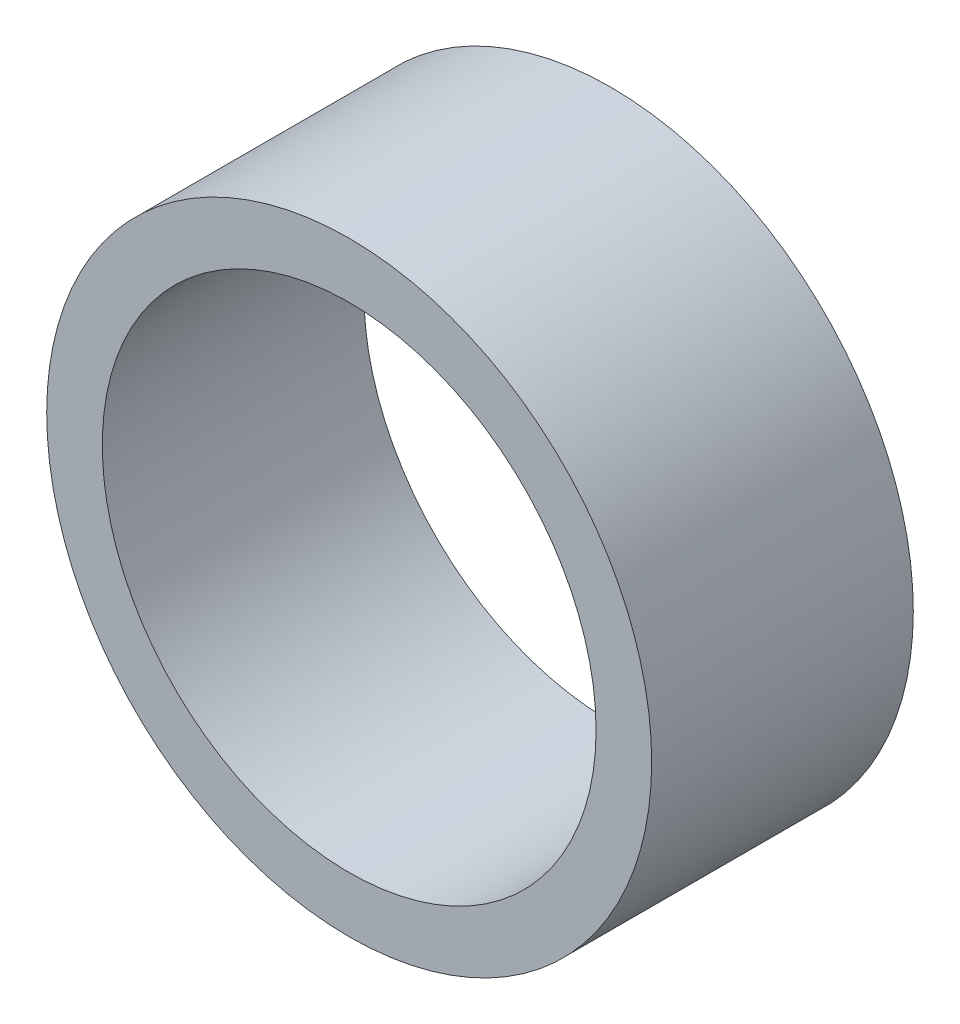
from build123d import *

# Parameters (mm, degrees)
ESQUISSE1_R          = 18.5
ESQUISSE1_R_2        = 15.1
BASE_EXTRUSION_DEPTH = 16


with BuildPart() as part:
    # Esquisse1 → Base-Extrusion (new body)
    with BuildSketch(Plane.XY):
        Circle(ESQUISSE1_R)
        Circle(ESQUISSE1_R_2, mode=Mode.SUBTRACT)
    extrude(amount=BASE_EXTRUSION_DEPTH)


solid = part.part
